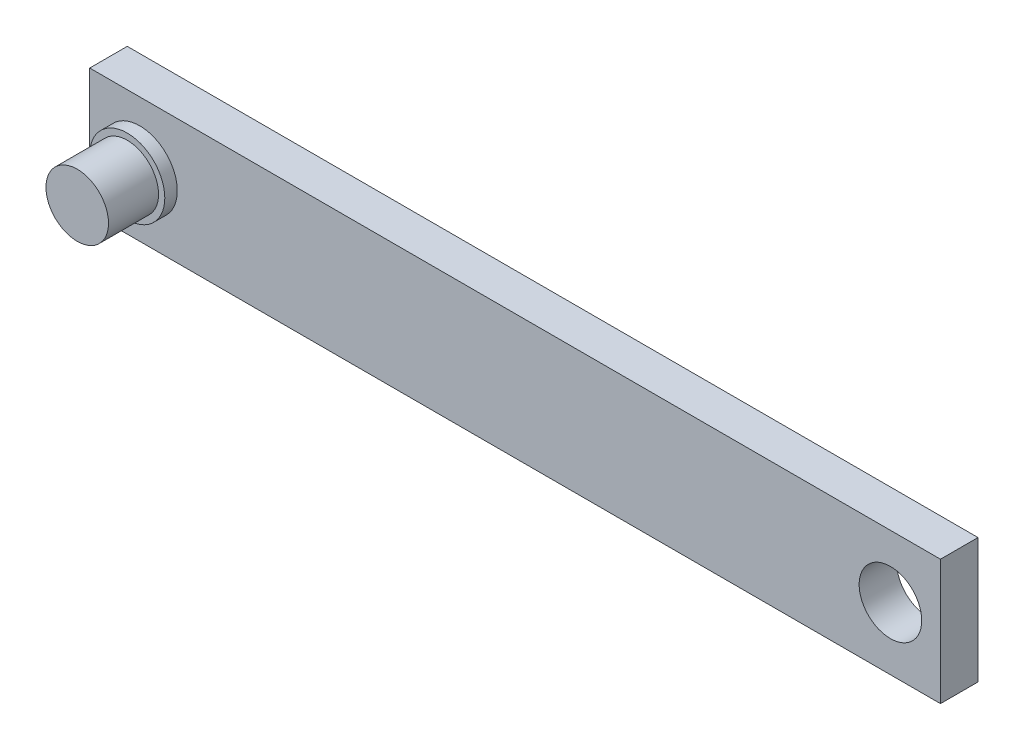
ISO-10303-21;
HEADER;
FILE_DESCRIPTION(('STEP AP214'),'2;1');
FILE_NAME('part.step','',(''),(''),'','','');
FILE_SCHEMA(('AUTOMOTIVE_DESIGN { 1 0 10303 214 1 1 1 1 }'));
ENDSEC;
DATA;
#1=APPLICATION_CONTEXT('core data for automotive mechanical design processes');
#2=APPLICATION_PROTOCOL_DEFINITION('international standard','automotive_design',2000,#1);
#3=PRODUCT_CONTEXT('',#1,'mechanical');
#4=PRODUCT('Part','Part','',(#3));
#5=PRODUCT_RELATED_PRODUCT_CATEGORY('part','',(#4));
#6=PRODUCT_DEFINITION_FORMATION('','',#4);
#7=PRODUCT_DEFINITION_CONTEXT('part definition',#1,'design');
#8=PRODUCT_DEFINITION('design','',#6,#7);
#9=PRODUCT_DEFINITION_SHAPE('','',#8);
#10=(LENGTH_UNIT() NAMED_UNIT(*) SI_UNIT(.MILLI.,.METRE.));
#11=(NAMED_UNIT(*) PLANE_ANGLE_UNIT() SI_UNIT($,.RADIAN.));
#12=(NAMED_UNIT(*) SI_UNIT($,.STERADIAN.) SOLID_ANGLE_UNIT());
#13=UNCERTAINTY_MEASURE_WITH_UNIT(LENGTH_MEASURE(1.E-05),#10,'distance_accuracy_value','');
#14=(GEOMETRIC_REPRESENTATION_CONTEXT(3) GLOBAL_UNCERTAINTY_ASSIGNED_CONTEXT((#13)) GLOBAL_UNIT_ASSIGNED_CONTEXT((#10,
#11,#12)) REPRESENTATION_CONTEXT('',''));
#15=CARTESIAN_POINT('',(0.,0.,0.));
#16=DIRECTION('',(0.,0.,1.));
#17=DIRECTION('',(1.,0.,0.));
#18=AXIS2_PLACEMENT_3D('',#15,#16,#17);
#19=CARTESIAN_POINT('',(40.,50.,40.));
#20=DIRECTION('',(0.,0.,1.));
#21=DIRECTION('',(1.,0.,0.));
#22=AXIS2_PLACEMENT_3D('',#19,#20,#21);
#23=PLANE('',#22);
#24=CARTESIAN_POINT('',(40.,50.,40.));
#25=DIRECTION('',(0.,0.,1.));
#26=DIRECTION('',(1.,0.,0.));
#27=AXIS2_PLACEMENT_3D('',#24,#25,#26);
#28=CIRCLE('',#27,30.);
#29=CARTESIAN_POINT('',(70.,50.,40.));
#30=VERTEX_POINT('',#29);
#31=EDGE_CURVE('E104',#30,#30,#28,.T.);
#32=ORIENTED_EDGE('',*,*,#31,.T.);
#33=EDGE_LOOP('',(#32));
#34=FACE_BOUND('',#33,.T.);
#35=CARTESIAN_POINT('',(40.,50.,40.));
#36=DIRECTION('',(0.,0.,1.));
#37=DIRECTION('',(1.,0.,0.));
#38=AXIS2_PLACEMENT_3D('',#35,#36,#37);
#39=CIRCLE('',#38,25.);
#40=CARTESIAN_POINT('',(65.,50.,40.));
#41=VERTEX_POINT('',#40);
#42=EDGE_CURVE('E157',#41,#41,#39,.T.);
#43=ORIENTED_EDGE('',*,*,#42,.F.);
#44=EDGE_LOOP('',(#43));
#45=FACE_BOUND('',#44,.T.);
#46=ADVANCED_FACE('F33',(#34,#45),#23,.T.);
#47=CARTESIAN_POINT('',(0.,100.,30.));
#48=DIRECTION('',(0.,0.,-1.));
#49=DIRECTION('',(-1.,0.,0.));
#50=AXIS2_PLACEMENT_3D('',#47,#48,#49);
#51=PLANE('',#50);
#52=CARTESIAN_POINT('',(640.,50.,30.));
#53=DIRECTION('',(0.,0.,1.));
#54=DIRECTION('',(1.,0.,0.));
#55=AXIS2_PLACEMENT_3D('',#52,#53,#54);
#56=CIRCLE('',#55,25.);
#57=CARTESIAN_POINT('',(665.,50.,30.));
#58=VERTEX_POINT('',#57);
#59=EDGE_CURVE('E155',#58,#58,#56,.T.);
#60=ORIENTED_EDGE('',*,*,#59,.F.);
#61=EDGE_LOOP('',(#60));
#62=FACE_BOUND('',#61,.T.);
#63=DIRECTION('',(0.,-1.,0.));
#64=VECTOR('',#63,1.);
#65=CARTESIAN_POINT('',(0.,0.,30.));
#66=LINE('',#65,#64);
#67=CARTESIAN_POINT('',(0.,100.,30.));
#68=VERTEX_POINT('',#67);
#69=CARTESIAN_POINT('',(0.,0.,30.));
#70=VERTEX_POINT('',#69);
#71=EDGE_CURVE('E87',#68,#70,#66,.T.);
#72=ORIENTED_EDGE('',*,*,#71,.T.);
#73=DIRECTION('',(1.,0.,0.));
#74=VECTOR('',#73,1.);
#75=CARTESIAN_POINT('',(0.,0.,30.));
#76=LINE('',#75,#74);
#77=CARTESIAN_POINT('',(680.,0.,30.));
#78=VERTEX_POINT('',#77);
#79=EDGE_CURVE('E81',#70,#78,#76,.T.);
#80=ORIENTED_EDGE('',*,*,#79,.T.);
#81=DIRECTION('',(0.,1.,0.));
#82=VECTOR('',#81,1.);
#83=CARTESIAN_POINT('',(680.,0.,30.));
#84=LINE('',#83,#82);
#85=CARTESIAN_POINT('',(680.,100.,30.));
#86=VERTEX_POINT('',#85);
#87=EDGE_CURVE('E85',#78,#86,#84,.T.);
#88=ORIENTED_EDGE('',*,*,#87,.T.);
#89=DIRECTION('',(-1.,0.,0.));
#90=VECTOR('',#89,1.);
#91=CARTESIAN_POINT('',(0.,100.,30.));
#92=LINE('',#91,#90);
#93=EDGE_CURVE('E50',#86,#68,#92,.T.);
#94=ORIENTED_EDGE('',*,*,#93,.T.);
#95=EDGE_LOOP('',(#72,#80,#88,#94));
#96=FACE_BOUND('',#95,.T.);
#97=CARTESIAN_POINT('',(40.,50.,30.));
#98=DIRECTION('',(0.,0.,-1.));
#99=DIRECTION('',(-1.,0.,0.));
#100=AXIS2_PLACEMENT_3D('',#97,#98,#99);
#101=CIRCLE('',#100,30.);
#102=CARTESIAN_POINT('',(10.,50.,30.));
#103=VERTEX_POINT('',#102);
#104=EDGE_CURVE('E11',#103,#103,#101,.F.);
#105=ORIENTED_EDGE('',*,*,#104,.F.);
#106=EDGE_LOOP('',(#105));
#107=FACE_BOUND('',#106,.T.);
#108=ADVANCED_FACE('F82',(#62,#96,#107),#51,.F.);
#109=CARTESIAN_POINT('',(0.,0.,30.));
#110=DIRECTION('',(1.,0.,0.));
#111=DIRECTION('',(0.,0.,-1.));
#112=AXIS2_PLACEMENT_3D('',#109,#110,#111);
#113=PLANE('',#112);
#114=DIRECTION('',(0.,-1.,0.));
#115=VECTOR('',#114,1.);
#116=CARTESIAN_POINT('',(0.,0.,0.));
#117=LINE('',#116,#115);
#118=CARTESIAN_POINT('',(0.,100.,0.));
#119=VERTEX_POINT('',#118);
#120=CARTESIAN_POINT('',(0.,0.,0.));
#121=VERTEX_POINT('',#120);
#122=EDGE_CURVE('E101',#119,#121,#117,.T.);
#123=ORIENTED_EDGE('',*,*,#122,.T.);
#124=DIRECTION('',(0.,0.,-1.));
#125=VECTOR('',#124,1.);
#126=CARTESIAN_POINT('',(0.,0.,30.));
#127=LINE('',#126,#125);
#128=EDGE_CURVE('E42',#70,#121,#127,.T.);
#129=ORIENTED_EDGE('',*,*,#128,.F.);
#130=ORIENTED_EDGE('',*,*,#71,.F.);
#131=DIRECTION('',(0.,0.,-1.));
#132=VECTOR('',#131,1.);
#133=CARTESIAN_POINT('',(0.,100.,30.));
#134=LINE('',#133,#132);
#135=EDGE_CURVE('E97',#68,#119,#134,.T.);
#136=ORIENTED_EDGE('',*,*,#135,.T.);
#137=EDGE_LOOP('',(#123,#129,#130,#136));
#138=FACE_BOUND('',#137,.T.);
#139=ADVANCED_FACE('F35',(#138),#113,.F.);
#140=CARTESIAN_POINT('',(0.,0.,30.));
#141=DIRECTION('',(0.,1.,0.));
#142=DIRECTION('',(0.,0.,1.));
#143=AXIS2_PLACEMENT_3D('',#140,#141,#142);
#144=PLANE('',#143);
#145=DIRECTION('',(1.,0.,0.));
#146=VECTOR('',#145,1.);
#147=CARTESIAN_POINT('',(0.,0.,0.));
#148=LINE('',#147,#146);
#149=CARTESIAN_POINT('',(680.,0.,0.));
#150=VERTEX_POINT('',#149);
#151=EDGE_CURVE('E92',#121,#150,#148,.T.);
#152=ORIENTED_EDGE('',*,*,#151,.T.);
#153=DIRECTION('',(0.,0.,-1.));
#154=VECTOR('',#153,1.);
#155=CARTESIAN_POINT('',(680.,0.,30.));
#156=LINE('',#155,#154);
#157=EDGE_CURVE('E90',#78,#150,#156,.T.);
#158=ORIENTED_EDGE('',*,*,#157,.F.);
#159=ORIENTED_EDGE('',*,*,#79,.F.);
#160=ORIENTED_EDGE('',*,*,#128,.T.);
#161=EDGE_LOOP('',(#152,#158,#159,#160));
#162=FACE_BOUND('',#161,.T.);
#163=ADVANCED_FACE('F91',(#162),#144,.F.);
#164=CARTESIAN_POINT('',(680.,0.,30.));
#165=DIRECTION('',(-1.,0.,0.));
#166=DIRECTION('',(0.,0.,1.));
#167=AXIS2_PLACEMENT_3D('',#164,#165,#166);
#168=PLANE('',#167);
#169=DIRECTION('',(0.,1.,0.));
#170=VECTOR('',#169,1.);
#171=CARTESIAN_POINT('',(680.,0.,0.));
#172=LINE('',#171,#170);
#173=CARTESIAN_POINT('',(680.,100.,0.));
#174=VERTEX_POINT('',#173);
#175=EDGE_CURVE('E67',#150,#174,#172,.T.);
#176=ORIENTED_EDGE('',*,*,#175,.T.);
#177=DIRECTION('',(0.,0.,-1.));
#178=VECTOR('',#177,1.);
#179=CARTESIAN_POINT('',(680.,100.,30.));
#180=LINE('',#179,#178);
#181=EDGE_CURVE('E93',#86,#174,#180,.T.);
#182=ORIENTED_EDGE('',*,*,#181,.F.);
#183=ORIENTED_EDGE('',*,*,#87,.F.);
#184=ORIENTED_EDGE('',*,*,#157,.T.);
#185=EDGE_LOOP('',(#176,#182,#183,#184));
#186=FACE_BOUND('',#185,.T.);
#187=ADVANCED_FACE('F95',(#186),#168,.F.);
#188=CARTESIAN_POINT('',(0.,100.,30.));
#189=DIRECTION('',(0.,-1.,0.));
#190=DIRECTION('',(0.,0.,-1.));
#191=AXIS2_PLACEMENT_3D('',#188,#189,#190);
#192=PLANE('',#191);
#193=DIRECTION('',(-1.,0.,0.));
#194=VECTOR('',#193,1.);
#195=CARTESIAN_POINT('',(0.,100.,0.));
#196=LINE('',#195,#194);
#197=EDGE_CURVE('E73',#174,#119,#196,.T.);
#198=ORIENTED_EDGE('',*,*,#197,.T.);
#199=ORIENTED_EDGE('',*,*,#135,.F.);
#200=ORIENTED_EDGE('',*,*,#93,.F.);
#201=ORIENTED_EDGE('',*,*,#181,.T.);
#202=EDGE_LOOP('',(#198,#199,#200,#201));
#203=FACE_BOUND('',#202,.T.);
#204=ADVANCED_FACE('F115',(#203),#192,.F.);
#205=CARTESIAN_POINT('',(0.,100.,0.));
#206=DIRECTION('',(0.,0.,-1.));
#207=DIRECTION('',(-1.,0.,0.));
#208=AXIS2_PLACEMENT_3D('',#205,#206,#207);
#209=PLANE('',#208);
#210=CARTESIAN_POINT('',(640.,50.,0.));
#211=DIRECTION('',(0.,0.,1.));
#212=DIRECTION('',(1.,0.,0.));
#213=AXIS2_PLACEMENT_3D('',#210,#211,#212);
#214=CIRCLE('',#213,25.);
#215=CARTESIAN_POINT('',(665.,50.,0.));
#216=VERTEX_POINT('',#215);
#217=EDGE_CURVE('E152',#216,#216,#214,.T.);
#218=ORIENTED_EDGE('',*,*,#217,.T.);
#219=EDGE_LOOP('',(#218));
#220=FACE_BOUND('',#219,.T.);
#221=ORIENTED_EDGE('',*,*,#122,.F.);
#222=ORIENTED_EDGE('',*,*,#197,.F.);
#223=ORIENTED_EDGE('',*,*,#175,.F.);
#224=ORIENTED_EDGE('',*,*,#151,.F.);
#225=EDGE_LOOP('',(#221,#222,#223,#224));
#226=FACE_BOUND('',#225,.T.);
#227=ADVANCED_FACE('F112',(#220,#226),#209,.T.);
#228=CARTESIAN_POINT('',(40.,50.,40.));
#229=DIRECTION('',(0.,0.,-1.));
#230=DIRECTION('',(-1.,0.,0.));
#231=AXIS2_PLACEMENT_3D('',#228,#229,#230);
#232=CYLINDRICAL_SURFACE('',#231,30.);
#233=ORIENTED_EDGE('',*,*,#31,.F.);
#234=EDGE_LOOP('',(#233));
#235=FACE_BOUND('',#234,.T.);
#236=ORIENTED_EDGE('',*,*,#104,.T.);
#237=EDGE_LOOP('',(#236));
#238=FACE_BOUND('',#237,.T.);
#239=ADVANCED_FACE('F114',(#235,#238),#232,.T.);
#240=CARTESIAN_POINT('',(40.,50.,80.));
#241=DIRECTION('',(0.,0.,-1.));
#242=DIRECTION('',(-1.,0.,0.));
#243=AXIS2_PLACEMENT_3D('',#240,#241,#242);
#244=CYLINDRICAL_SURFACE('',#243,25.);
#245=CARTESIAN_POINT('',(40.,50.,80.));
#246=DIRECTION('',(0.,0.,1.));
#247=DIRECTION('',(1.,0.,0.));
#248=AXIS2_PLACEMENT_3D('',#245,#246,#247);
#249=CIRCLE('',#248,25.);
#250=CARTESIAN_POINT('',(65.,50.,80.));
#251=VERTEX_POINT('',#250);
#252=EDGE_CURVE('E160',#251,#251,#249,.T.);
#253=ORIENTED_EDGE('',*,*,#252,.F.);
#254=EDGE_LOOP('',(#253));
#255=FACE_BOUND('',#254,.T.);
#256=ORIENTED_EDGE('',*,*,#42,.T.);
#257=EDGE_LOOP('',(#256));
#258=FACE_BOUND('',#257,.T.);
#259=ADVANCED_FACE('F122',(#255,#258),#244,.T.);
#260=CARTESIAN_POINT('',(40.,50.,80.));
#261=DIRECTION('',(0.,0.,1.));
#262=DIRECTION('',(1.,0.,0.));
#263=AXIS2_PLACEMENT_3D('',#260,#261,#262);
#264=PLANE('',#263);
#265=ORIENTED_EDGE('',*,*,#252,.T.);
#266=EDGE_LOOP('',(#265));
#267=FACE_BOUND('',#266,.T.);
#268=ADVANCED_FACE('F140',(#267),#264,.T.);
#269=CARTESIAN_POINT('',(640.,50.,0.));
#270=DIRECTION('',(0.,0.,1.));
#271=DIRECTION('',(1.,0.,0.));
#272=AXIS2_PLACEMENT_3D('',#269,#270,#271);
#273=CYLINDRICAL_SURFACE('',#272,25.);
#274=ORIENTED_EDGE('',*,*,#217,.F.);
#275=EDGE_LOOP('',(#274));
#276=FACE_BOUND('',#275,.T.);
#277=ORIENTED_EDGE('',*,*,#59,.T.);
#278=EDGE_LOOP('',(#277));
#279=FACE_BOUND('',#278,.T.);
#280=ADVANCED_FACE('F144',(#276,#279),#273,.F.);
#281=CLOSED_SHELL('',(#46,#108,#139,#163,#187,#204,#227,#239,#259,#268,#280));
#282=MANIFOLD_SOLID_BREP('B2',#281);
#283=ADVANCED_BREP_SHAPE_REPRESENTATION('',(#18,#282),#14);
#284=SHAPE_DEFINITION_REPRESENTATION(#9,#283);
ENDSEC;
END-ISO-10303-21;
